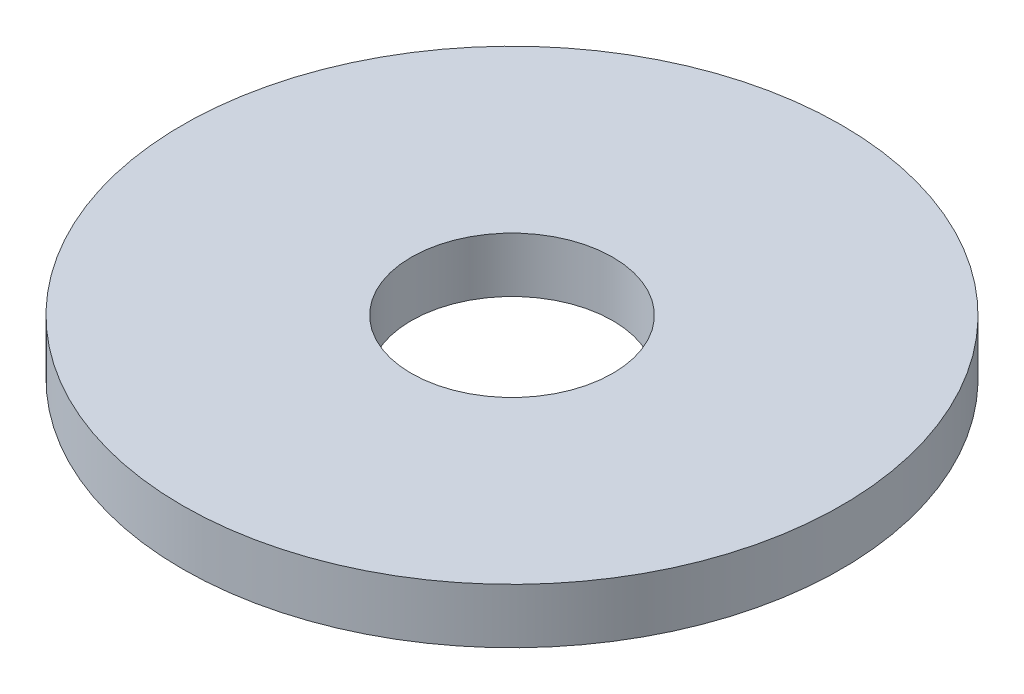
ISO-10303-21;
HEADER;
FILE_DESCRIPTION(('STEP AP214'),'2;1');
FILE_NAME('part.step','',(''),(''),'','','');
FILE_SCHEMA(('AUTOMOTIVE_DESIGN { 1 0 10303 214 1 1 1 1 }'));
ENDSEC;
DATA;
#1=APPLICATION_CONTEXT('core data for automotive mechanical design processes');
#2=APPLICATION_PROTOCOL_DEFINITION('international standard','automotive_design',2000,#1);
#3=PRODUCT_CONTEXT('',#1,'mechanical');
#4=PRODUCT('Part','Part','',(#3));
#5=PRODUCT_RELATED_PRODUCT_CATEGORY('part','',(#4));
#6=PRODUCT_DEFINITION_FORMATION('','',#4);
#7=PRODUCT_DEFINITION_CONTEXT('part definition',#1,'design');
#8=PRODUCT_DEFINITION('design','',#6,#7);
#9=PRODUCT_DEFINITION_SHAPE('','',#8);
#10=(LENGTH_UNIT() NAMED_UNIT(*) SI_UNIT(.MILLI.,.METRE.));
#11=(NAMED_UNIT(*) PLANE_ANGLE_UNIT() SI_UNIT($,.RADIAN.));
#12=(NAMED_UNIT(*) SI_UNIT($,.STERADIAN.) SOLID_ANGLE_UNIT());
#13=UNCERTAINTY_MEASURE_WITH_UNIT(LENGTH_MEASURE(1.E-05),#10,'distance_accuracy_value','');
#14=(GEOMETRIC_REPRESENTATION_CONTEXT(3) GLOBAL_UNCERTAINTY_ASSIGNED_CONTEXT((#13)) GLOBAL_UNIT_ASSIGNED_CONTEXT((#10,
#11,#12)) REPRESENTATION_CONTEXT('',''));
#15=CARTESIAN_POINT('',(0.,0.,0.));
#16=DIRECTION('',(0.,0.,1.));
#17=DIRECTION('',(1.,0.,0.));
#18=AXIS2_PLACEMENT_3D('',#15,#16,#17);
#19=CARTESIAN_POINT('',(0.,-6.,0.));
#20=DIRECTION('',(0.,1.,0.));
#21=DIRECTION('',(0.,0.,1.));
#22=AXIS2_PLACEMENT_3D('',#19,#20,#21);
#23=CYLINDRICAL_SURFACE('',#22,36.);
#24=CARTESIAN_POINT('',(0.,-6.,0.));
#25=DIRECTION('',(0.,1.,0.));
#26=DIRECTION('',(0.,0.,1.));
#27=AXIS2_PLACEMENT_3D('',#24,#25,#26);
#28=CIRCLE('',#27,36.);
#29=CARTESIAN_POINT('',(0.,-6.,36.));
#30=VERTEX_POINT('',#29);
#31=EDGE_CURVE('E10',#30,#30,#28,.T.);
#32=ORIENTED_EDGE('',*,*,#31,.T.);
#33=EDGE_LOOP('',(#32));
#34=FACE_BOUND('',#33,.T.);
#35=CARTESIAN_POINT('',(0.,0.,0.));
#36=DIRECTION('',(0.,1.,0.));
#37=DIRECTION('',(0.,0.,1.));
#38=AXIS2_PLACEMENT_3D('',#35,#36,#37);
#39=CIRCLE('',#38,36.);
#40=CARTESIAN_POINT('',(0.,0.,36.));
#41=VERTEX_POINT('',#40);
#42=EDGE_CURVE('E34',#41,#41,#39,.T.);
#43=ORIENTED_EDGE('',*,*,#42,.F.);
#44=EDGE_LOOP('',(#43));
#45=FACE_BOUND('',#44,.T.);
#46=ADVANCED_FACE('F31',(#34,#45),#23,.T.);
#47=CARTESIAN_POINT('',(0.,-6.,0.));
#48=DIRECTION('',(0.,1.,0.));
#49=DIRECTION('',(0.,0.,1.));
#50=AXIS2_PLACEMENT_3D('',#47,#48,#49);
#51=PLANE('',#50);
#52=CARTESIAN_POINT('',(0.,-6.,0.));
#53=DIRECTION('',(0.,1.,0.));
#54=DIRECTION('',(0.,0.,1.));
#55=AXIS2_PLACEMENT_3D('',#52,#53,#54);
#56=CIRCLE('',#55,11.);
#57=CARTESIAN_POINT('',(0.,-6.,11.));
#58=VERTEX_POINT('',#57);
#59=EDGE_CURVE('E41',#58,#58,#56,.T.);
#60=ORIENTED_EDGE('',*,*,#59,.T.);
#61=EDGE_LOOP('',(#60));
#62=FACE_BOUND('',#61,.T.);
#63=ORIENTED_EDGE('',*,*,#31,.F.);
#64=EDGE_LOOP('',(#63));
#65=FACE_BOUND('',#64,.T.);
#66=ADVANCED_FACE('F49',(#62,#65),#51,.F.);
#67=CARTESIAN_POINT('',(0.,0.,0.));
#68=DIRECTION('',(0.,1.,0.));
#69=DIRECTION('',(0.,0.,1.));
#70=AXIS2_PLACEMENT_3D('',#67,#68,#69);
#71=PLANE('',#70);
#72=CARTESIAN_POINT('',(0.,0.,0.));
#73=DIRECTION('',(0.,1.,0.));
#74=DIRECTION('',(0.,0.,1.));
#75=AXIS2_PLACEMENT_3D('',#72,#73,#74);
#76=CIRCLE('',#75,11.);
#77=CARTESIAN_POINT('',(0.,0.,11.));
#78=VERTEX_POINT('',#77);
#79=EDGE_CURVE('E43',#78,#78,#76,.T.);
#80=ORIENTED_EDGE('',*,*,#79,.F.);
#81=EDGE_LOOP('',(#80));
#82=FACE_BOUND('',#81,.T.);
#83=ORIENTED_EDGE('',*,*,#42,.T.);
#84=EDGE_LOOP('',(#83));
#85=FACE_BOUND('',#84,.T.);
#86=ADVANCED_FACE('F55',(#82,#85),#71,.T.);
#87=CARTESIAN_POINT('',(0.,-6.,0.));
#88=DIRECTION('',(0.,1.,0.));
#89=DIRECTION('',(0.,0.,1.));
#90=AXIS2_PLACEMENT_3D('',#87,#88,#89);
#91=CYLINDRICAL_SURFACE('',#90,11.);
#92=ORIENTED_EDGE('',*,*,#59,.F.);
#93=EDGE_LOOP('',(#92));
#94=FACE_BOUND('',#93,.T.);
#95=ORIENTED_EDGE('',*,*,#79,.T.);
#96=EDGE_LOOP('',(#95));
#97=FACE_BOUND('',#96,.T.);
#98=ADVANCED_FACE('F52',(#94,#97),#91,.F.);
#99=CLOSED_SHELL('',(#46,#66,#86,#98));
#100=MANIFOLD_SOLID_BREP('B2',#99);
#101=ADVANCED_BREP_SHAPE_REPRESENTATION('',(#18,#100),#14);
#102=SHAPE_DEFINITION_REPRESENTATION(#9,#101);
ENDSEC;
END-ISO-10303-21;
